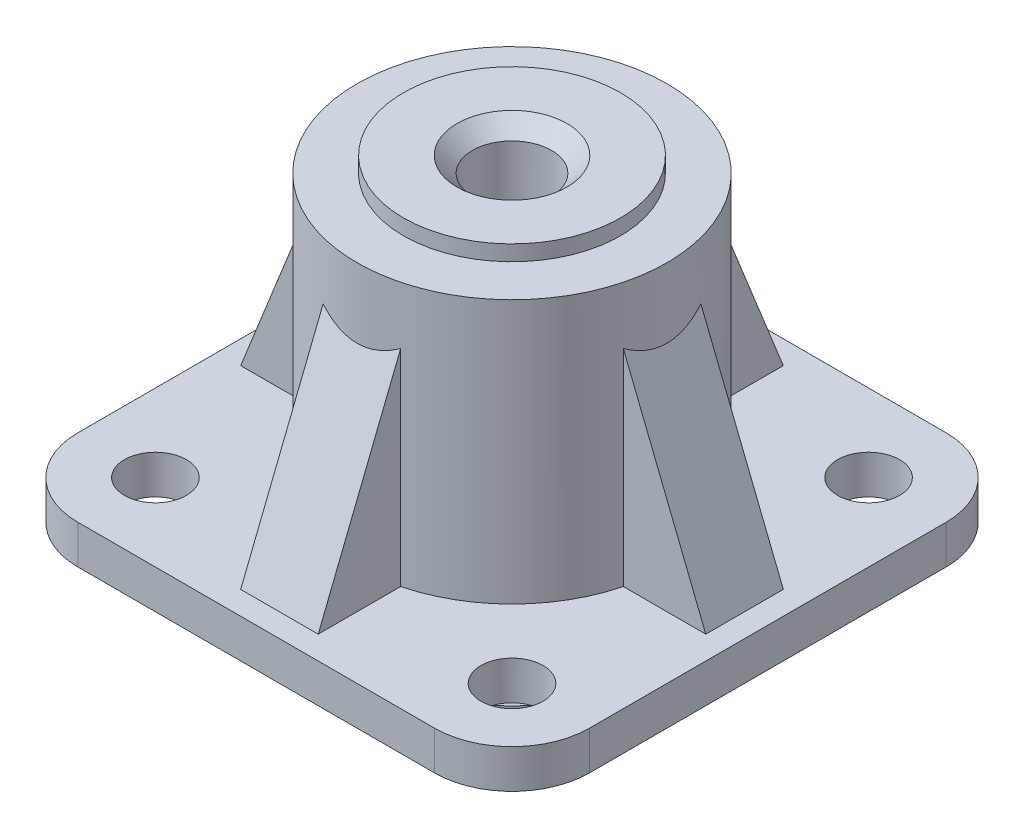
from build123d import *

# Parameters (mm, degrees)
SKETCH2_R              = 4
BOSS_EXTRUDE1_DEPTH    = 5
M12_TAPPED_HOLE1_D     = 10.2
M12_TAPPED_HOLE1_DEPTH = 16
CHAMFER1_SIZE          = 2
RIB1_REACH             = 67.529
SKETCH5_WALL_W         = 164.050768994
SKETCH5_WALL_H         = 10
CIRPATTERN1_COUNT      = 4
CUT_EXTRUDE1_REACH     = 64.121
SKETCH6_R              = 4.005


with BuildPart() as part:
    # Sketch1 → Revolve1 (revolve)
    with BuildSketch(Plane.XY, mode=Mode.PRIVATE) as revolve1_sk:
        Polygon((0, 46), (14, 46), (14, 44), (20, 44), (20, 5), (29, 5), (29, 3), (18, 3), (18, 0), (15, 0), (15, 34), (10, 34), (10, 30), (0, 30), align=None)
    revolve(revolve1_sk.sketch.rotate(Axis((0, 0, 0), (0, 1, 0)), 90), axis=Axis((0, 0, 0), (0, 1, 0)))

    # Sketch2 → Boss-Extrude1 (add)
    with BuildSketch(Plane(origin=(0, 5, 0), x_dir=(1, 0, 0), z_dir=(0, 1, 0))):
        with BuildLine():
            Line((-23, 33), (23, 33))
            ThreePointArc((23, 33), (30.071067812, 30.071067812), (33, 23))
            Line((33, 23), (33, -23))
            ThreePointArc((33, -23), (30.071067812, -30.071067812), (23, -33))
            Line((23, -33), (-23, -33))
            ThreePointArc((-23, -33), (-30.071067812, -30.071067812), (-33, -23))
            Line((-33, -23), (-33, 23))
            ThreePointArc((-33, 23), (-30.071067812, 30.071067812), (-23, 33))
        make_face()
        with Locations(Location((-23, 23, 0), (0, 0, 341.438550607))):
            Circle(SKETCH2_R, mode=Mode.SUBTRACT)
        with Locations(Location((23, 23, 0), (0, 0, 198.561449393))):
            Circle(SKETCH2_R, mode=Mode.SUBTRACT)
        with Locations(Location((23, -23, 0), (0, 0, 108.561449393))):
            Circle(SKETCH2_R, mode=Mode.SUBTRACT)
        with Locations(Location((-23, -23, 0), (0, 0, 71.438550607))):
            Circle(SKETCH2_R, mode=Mode.SUBTRACT)
    extrude(amount=BOSS_EXTRUDE1_DEPTH)

    # M12 Tapped Hole1
    with Locations(Plane(origin=(0, 46, 0), x_dir=(1, 0, 0), z_dir=(0, 1, 0))):
        with Locations((0, 0)):
            Hole(M12_TAPPED_HOLE1_D / 2, depth=M12_TAPPED_HOLE1_DEPTH)

    # Chamfer1
    chamfer1_edges = [part.edges().sort_by_distance(p)[0] for p in [
        (5.1, 46, 0),
    ]]
    chamfer(chamfer1_edges, length=CHAMFER1_SIZE)

    # Sketch5 wall → Rib1 (add, up to next)
    with BuildSketch(Plane(origin=(-24.245, 24.388526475, 0), x_dir=(0.371367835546, 0.928485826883, 0), z_dir=(-0.928485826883, 0.371367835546, 0)), mode=Mode.PRIVATE) as rib1_sk1:
        Rectangle(SKETCH5_WALL_W, SKETCH5_WALL_H)
    rib1_tool1 = extrude(rib1_sk1.sketch, amount=-RIB1_REACH, mode=Mode.PRIVATE) - part.part
    rib1 = rib1_tool1.solids().sort_by_distance((-24.245, 24.388526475, 0))[0]
    add(rib1)

    # CirPattern1: Rib1 ×4 about axis
    cirpattern1_axis = Axis((0, 0, 0), (0, 1, 0))
    for i in range(1, CIRPATTERN1_COUNT):
        add(rib1.rotate(cirpattern1_axis, i * 360 / CIRPATTERN1_COUNT))

    # Sketch6 → Cut-Extrude1 (cut, up to next)
    with BuildSketch(Plane.XZ.offset(-5), mode=Mode.PRIVATE) as cut_extrude1_sk1:
        with Locations(Location((0, 0, 0), (0, 0, 270))):
            Circle(SKETCH6_R)
    cut_extrude1_tool1 = extrude(cut_extrude1_sk1.sketch, amount=-CUT_EXTRUDE1_REACH, mode=Mode.PRIVATE) & part.part
    add(cut_extrude1_tool1.solids().sort_by_distance((0, 5, 0))[0], mode=Mode.SUBTRACT)


solid = part.part
